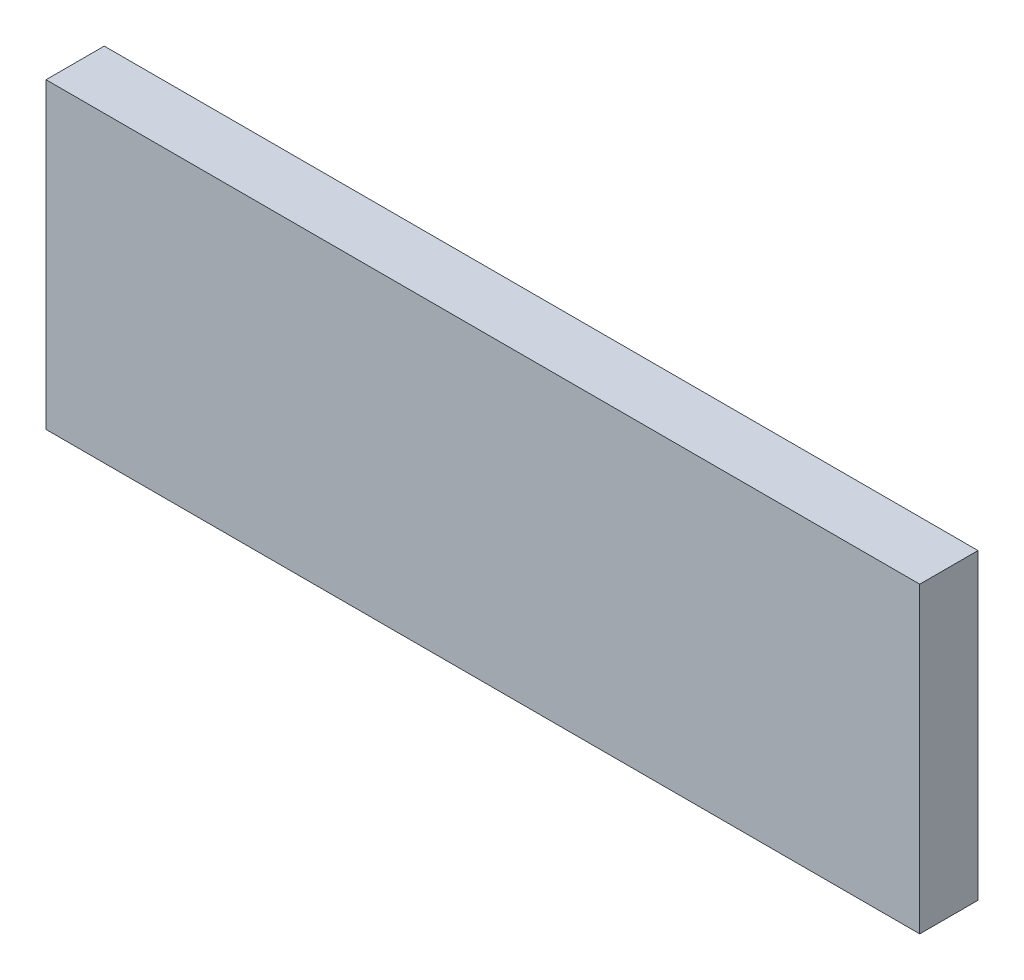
ISO-10303-21;
HEADER;
FILE_DESCRIPTION(('STEP AP214'),'2;1');
FILE_NAME('part.step','',(''),(''),'','','');
FILE_SCHEMA(('AUTOMOTIVE_DESIGN { 1 0 10303 214 1 1 1 1 }'));
ENDSEC;
DATA;
#1=APPLICATION_CONTEXT('core data for automotive mechanical design processes');
#2=APPLICATION_PROTOCOL_DEFINITION('international standard','automotive_design',2000,#1);
#3=PRODUCT_CONTEXT('',#1,'mechanical');
#4=PRODUCT('Part','Part','',(#3));
#5=PRODUCT_RELATED_PRODUCT_CATEGORY('part','',(#4));
#6=PRODUCT_DEFINITION_FORMATION('','',#4);
#7=PRODUCT_DEFINITION_CONTEXT('part definition',#1,'design');
#8=PRODUCT_DEFINITION('design','',#6,#7);
#9=PRODUCT_DEFINITION_SHAPE('','',#8);
#10=(LENGTH_UNIT() NAMED_UNIT(*) SI_UNIT(.MILLI.,.METRE.));
#11=(NAMED_UNIT(*) PLANE_ANGLE_UNIT() SI_UNIT($,.RADIAN.));
#12=(NAMED_UNIT(*) SI_UNIT($,.STERADIAN.) SOLID_ANGLE_UNIT());
#13=UNCERTAINTY_MEASURE_WITH_UNIT(LENGTH_MEASURE(1.E-05),#10,'distance_accuracy_value','');
#14=(GEOMETRIC_REPRESENTATION_CONTEXT(3) GLOBAL_UNCERTAINTY_ASSIGNED_CONTEXT((#13)) GLOBAL_UNIT_ASSIGNED_CONTEXT((#10,
#11,#12)) REPRESENTATION_CONTEXT('',''));
#15=CARTESIAN_POINT('',(0.,0.,0.));
#16=DIRECTION('',(0.,0.,1.));
#17=DIRECTION('',(1.,0.,0.));
#18=AXIS2_PLACEMENT_3D('',#15,#16,#17);
#19=CARTESIAN_POINT('',(-67.82802259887,47.671581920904,10.));
#20=DIRECTION('',(1.,0.,0.));
#21=DIRECTION('',(0.,0.,-1.));
#22=AXIS2_PLACEMENT_3D('',#19,#20,#21);
#23=PLANE('',#22);
#24=DIRECTION('',(0.,-1.,0.));
#25=VECTOR('',#24,1.);
#26=CARTESIAN_POINT('',(-67.82802259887,47.671581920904,0.));
#27=LINE('',#26,#25);
#28=CARTESIAN_POINT('',(-67.82802259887,47.671581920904,0.));
#29=VERTEX_POINT('',#28);
#30=CARTESIAN_POINT('',(-67.82802259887,-4.32841807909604,0.));
#31=VERTEX_POINT('',#30);
#32=EDGE_CURVE('E462',#29,#31,#27,.T.);
#33=ORIENTED_EDGE('',*,*,#32,.T.);
#34=DIRECTION('',(0.,0.,-1.));
#35=VECTOR('',#34,1.);
#36=CARTESIAN_POINT('',(-67.82802259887,-4.32841807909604,10.));
#37=LINE('',#36,#35);
#38=CARTESIAN_POINT('',(-67.82802259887,-4.32841807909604,10.));
#39=VERTEX_POINT('',#38);
#40=EDGE_CURVE('E11',#39,#31,#37,.T.);
#41=ORIENTED_EDGE('',*,*,#40,.F.);
#42=DIRECTION('',(0.,-1.,0.));
#43=VECTOR('',#42,1.);
#44=CARTESIAN_POINT('',(-67.82802259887,47.671581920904,10.));
#45=LINE('',#44,#43);
#46=CARTESIAN_POINT('',(-67.82802259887,47.671581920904,10.));
#47=VERTEX_POINT('',#46);
#48=EDGE_CURVE('E480',#47,#39,#45,.T.);
#49=ORIENTED_EDGE('',*,*,#48,.F.);
#50=DIRECTION('',(0.,0.,-1.));
#51=VECTOR('',#50,1.);
#52=CARTESIAN_POINT('',(-67.82802259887,47.671581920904,10.));
#53=LINE('',#52,#51);
#54=EDGE_CURVE('E474',#47,#29,#53,.T.);
#55=ORIENTED_EDGE('',*,*,#54,.T.);
#56=EDGE_LOOP('',(#33,#41,#49,#55));
#57=FACE_BOUND('',#56,.T.);
#58=ADVANCED_FACE('F418',(#57),#23,.F.);
#59=CARTESIAN_POINT('',(-67.82802259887,-4.32841807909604,10.));
#60=DIRECTION('',(0.,1.,0.));
#61=DIRECTION('',(0.,0.,1.));
#62=AXIS2_PLACEMENT_3D('',#59,#60,#61);
#63=PLANE('',#62);
#64=DIRECTION('',(1.,0.,0.));
#65=VECTOR('',#64,1.);
#66=CARTESIAN_POINT('',(-67.82802259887,-4.32841807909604,0.));
#67=LINE('',#66,#65);
#68=CARTESIAN_POINT('',(82.1719774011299,-4.32841807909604,0.));
#69=VERTEX_POINT('',#68);
#70=EDGE_CURVE('E458',#31,#69,#67,.T.);
#71=ORIENTED_EDGE('',*,*,#70,.T.);
#72=DIRECTION('',(0.,0.,-1.));
#73=VECTOR('',#72,1.);
#74=CARTESIAN_POINT('',(82.1719774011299,-4.32841807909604,10.));
#75=LINE('',#74,#73);
#76=CARTESIAN_POINT('',(82.1719774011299,-4.32841807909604,10.));
#77=VERTEX_POINT('',#76);
#78=EDGE_CURVE('E425',#77,#69,#75,.T.);
#79=ORIENTED_EDGE('',*,*,#78,.F.);
#80=DIRECTION('',(1.,0.,0.));
#81=VECTOR('',#80,1.);
#82=CARTESIAN_POINT('',(-67.82802259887,-4.32841807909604,10.));
#83=LINE('',#82,#81);
#84=EDGE_CURVE('E470',#39,#77,#83,.T.);
#85=ORIENTED_EDGE('',*,*,#84,.F.);
#86=ORIENTED_EDGE('',*,*,#40,.T.);
#87=EDGE_LOOP('',(#71,#79,#85,#86));
#88=FACE_BOUND('',#87,.T.);
#89=ADVANCED_FACE('F469',(#88),#63,.F.);
#90=CARTESIAN_POINT('',(82.1719774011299,47.671581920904,10.));
#91=DIRECTION('',(-1.,0.,0.));
#92=DIRECTION('',(0.,-1.,0.));
#93=AXIS2_PLACEMENT_3D('',#90,#91,#92);
#94=PLANE('',#93);
#95=DIRECTION('',(0.,1.,0.));
#96=VECTOR('',#95,1.);
#97=CARTESIAN_POINT('',(82.1719774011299,47.671581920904,0.));
#98=LINE('',#97,#96);
#99=CARTESIAN_POINT('',(82.1719774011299,47.671581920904,0.));
#100=VERTEX_POINT('',#99);
#101=EDGE_CURVE('E463',#69,#100,#98,.T.);
#102=ORIENTED_EDGE('',*,*,#101,.T.);
#103=DIRECTION('',(0.,0.,-1.));
#104=VECTOR('',#103,1.);
#105=CARTESIAN_POINT('',(82.1719774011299,47.671581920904,10.));
#106=LINE('',#105,#104);
#107=CARTESIAN_POINT('',(82.1719774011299,47.671581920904,10.));
#108=VERTEX_POINT('',#107);
#109=EDGE_CURVE('E486',#108,#100,#106,.T.);
#110=ORIENTED_EDGE('',*,*,#109,.F.);
#111=DIRECTION('',(0.,1.,0.));
#112=VECTOR('',#111,1.);
#113=CARTESIAN_POINT('',(82.1719774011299,47.671581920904,10.));
#114=LINE('',#113,#112);
#115=EDGE_CURVE('E437',#77,#108,#114,.T.);
#116=ORIENTED_EDGE('',*,*,#115,.F.);
#117=ORIENTED_EDGE('',*,*,#78,.T.);
#118=EDGE_LOOP('',(#102,#110,#116,#117));
#119=FACE_BOUND('',#118,.T.);
#120=ADVANCED_FACE('F489',(#119),#94,.F.);
#121=CARTESIAN_POINT('',(-67.82802259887,47.671581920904,10.));
#122=DIRECTION('',(0.,-1.,0.));
#123=DIRECTION('',(0.,0.,-1.));
#124=AXIS2_PLACEMENT_3D('',#121,#122,#123);
#125=PLANE('',#124);
#126=DIRECTION('',(-1.,0.,0.));
#127=VECTOR('',#126,1.);
#128=CARTESIAN_POINT('',(-67.82802259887,47.671581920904,0.));
#129=LINE('',#128,#127);
#130=EDGE_CURVE('E478',#100,#29,#129,.T.);
#131=ORIENTED_EDGE('',*,*,#130,.T.);
#132=ORIENTED_EDGE('',*,*,#54,.F.);
#133=DIRECTION('',(-1.,0.,0.));
#134=VECTOR('',#133,1.);
#135=CARTESIAN_POINT('',(-67.82802259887,47.671581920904,10.));
#136=LINE('',#135,#134);
#137=EDGE_CURVE('E432',#108,#47,#136,.T.);
#138=ORIENTED_EDGE('',*,*,#137,.F.);
#139=ORIENTED_EDGE('',*,*,#109,.T.);
#140=EDGE_LOOP('',(#131,#132,#138,#139));
#141=FACE_BOUND('',#140,.T.);
#142=ADVANCED_FACE('F491',(#141),#125,.F.);
#143=CARTESIAN_POINT('',(-67.82802259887,-4.32841807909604,10.));
#144=DIRECTION('',(0.,0.,1.));
#145=DIRECTION('',(1.,0.,0.));
#146=AXIS2_PLACEMENT_3D('',#143,#144,#145);
#147=PLANE('',#146);
#148=ORIENTED_EDGE('',*,*,#48,.T.);
#149=ORIENTED_EDGE('',*,*,#84,.T.);
#150=ORIENTED_EDGE('',*,*,#115,.T.);
#151=ORIENTED_EDGE('',*,*,#137,.T.);
#152=EDGE_LOOP('',(#148,#149,#150,#151));
#153=FACE_BOUND('',#152,.T.);
#154=ADVANCED_FACE('F492',(#153),#147,.T.);
#155=CARTESIAN_POINT('',(-67.82802259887,-4.32841807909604,0.));
#156=DIRECTION('',(0.,0.,1.));
#157=DIRECTION('',(1.,0.,0.));
#158=AXIS2_PLACEMENT_3D('',#155,#156,#157);
#159=PLANE('',#158);
#160=ORIENTED_EDGE('',*,*,#32,.F.);
#161=ORIENTED_EDGE('',*,*,#130,.F.);
#162=ORIENTED_EDGE('',*,*,#101,.F.);
#163=ORIENTED_EDGE('',*,*,#70,.F.);
#164=EDGE_LOOP('',(#160,#161,#162,#163));
#165=FACE_BOUND('',#164,.T.);
#166=ADVANCED_FACE('F459',(#165),#159,.F.);
#167=CLOSED_SHELL('',(#58,#89,#120,#142,#154,#166));
#168=MANIFOLD_SOLID_BREP('B2',#167);
#169=ADVANCED_BREP_SHAPE_REPRESENTATION('',(#18,#168),#14);
#170=SHAPE_DEFINITION_REPRESENTATION(#9,#169);
ENDSEC;
END-ISO-10303-21;
